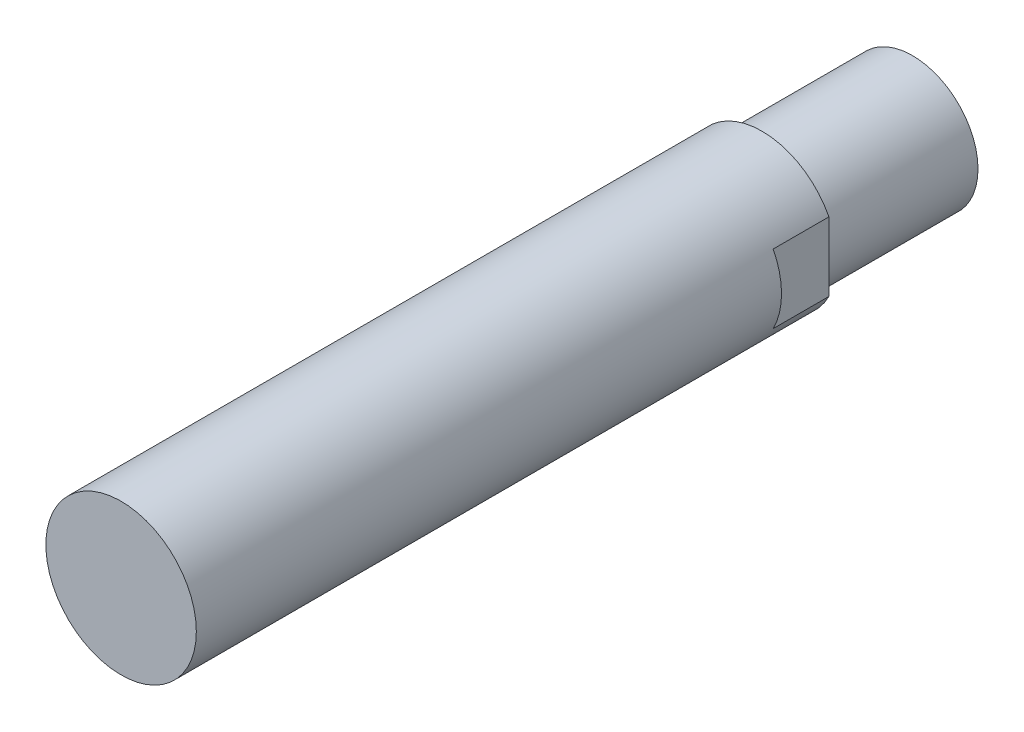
from build123d import *

# Parameters (mm, degrees)
ESQUISSE1_R             = 13.5
EXTRUSION1_DEPTH        = 142
ENL_V_START             = -115
ESQUISSE2_OUTSIDE_W     = 58.408
ESQUISSE2_OUTSIDE_H     = 58.408
ESQUISSE2_OUTSIDE_W_2   = 24
ESQUISSE2_OUTSIDE_H_2   = 27
ENL_V_MAT_EXTRU_1_DEPTH = 10
ESQUISSE3_OUTSIDE_W     = 58.408
ESQUISSE3_OUTSIDE_H     = 58.408
ESQUISSE3_OUTSIDE_R     = 11.75
ENL_V_MAT_EXTRU_2_DEPTH = 29.277702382


with BuildPart() as part:
    # Esquisse1 → Extrusion1 (new body)
    with BuildSketch(Plane.XY):
        Circle(ESQUISSE1_R)
    extrude(amount=-EXTRUSION1_DEPTH)

    # Esquisse2 outside → Enl_v. mat.-Extru.1 (cut)
    with BuildSketch(Plane.XY.offset(ENL_V_START)):
        Rectangle(ESQUISSE2_OUTSIDE_W, ESQUISSE2_OUTSIDE_H)
        Rectangle(ESQUISSE2_OUTSIDE_W_2, ESQUISSE2_OUTSIDE_H_2, mode=Mode.SUBTRACT)
    extrude(amount=ENL_V_MAT_EXTRU_1_DEPTH, mode=Mode.SUBTRACT)

    # Esquisse3 outside → Enl_v. mat.-Extru.2 (cut, through all)
    with BuildSketch(Plane.XY.offset(ENL_V_START)):
        Rectangle(ESQUISSE3_OUTSIDE_W, ESQUISSE3_OUTSIDE_H)
        Circle(ESQUISSE3_OUTSIDE_R, mode=Mode.SUBTRACT)
    extrude(amount=-ENL_V_MAT_EXTRU_2_DEPTH, mode=Mode.SUBTRACT)


solid = part.part
